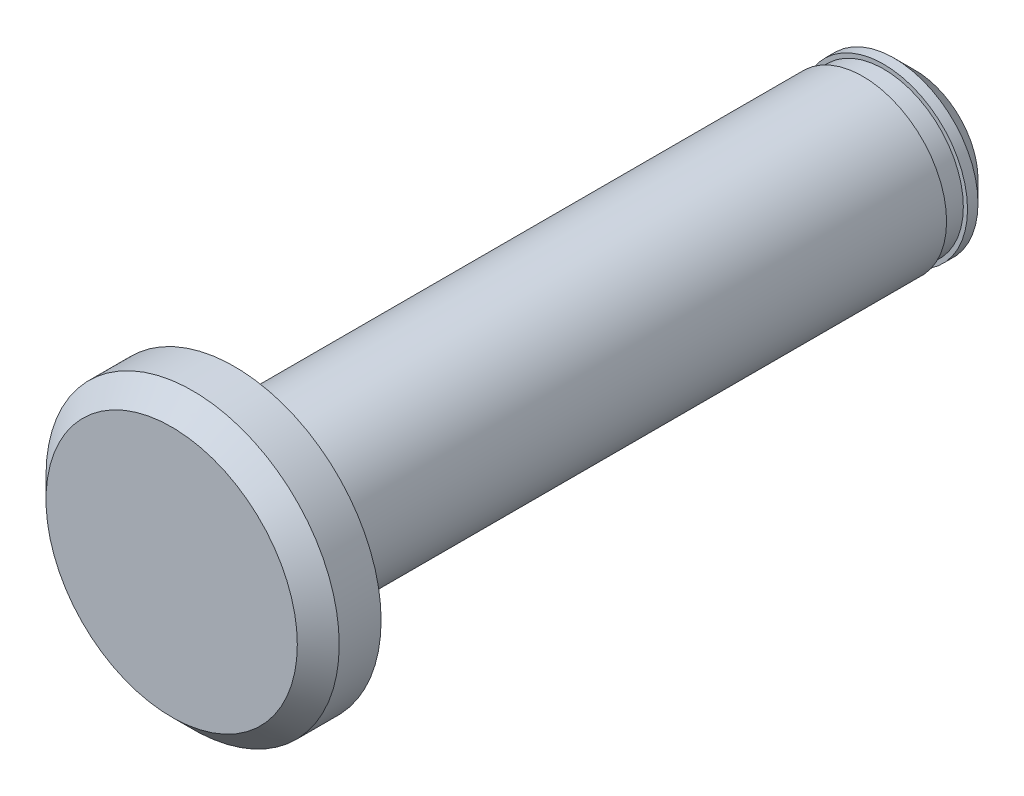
ISO-10303-21;
HEADER;
FILE_DESCRIPTION(('STEP AP214'),'2;1');
FILE_NAME('part.step','',(''),(''),'','','');
FILE_SCHEMA(('AUTOMOTIVE_DESIGN { 1 0 10303 214 1 1 1 1 }'));
ENDSEC;
DATA;
#1=APPLICATION_CONTEXT('core data for automotive mechanical design processes');
#2=APPLICATION_PROTOCOL_DEFINITION('international standard','automotive_design',2000,#1);
#3=PRODUCT_CONTEXT('',#1,'mechanical');
#4=PRODUCT('Part','Part','',(#3));
#5=PRODUCT_RELATED_PRODUCT_CATEGORY('part','',(#4));
#6=PRODUCT_DEFINITION_FORMATION('','',#4);
#7=PRODUCT_DEFINITION_CONTEXT('part definition',#1,'design');
#8=PRODUCT_DEFINITION('design','',#6,#7);
#9=PRODUCT_DEFINITION_SHAPE('','',#8);
#10=(LENGTH_UNIT() NAMED_UNIT(*) SI_UNIT(.MILLI.,.METRE.));
#11=(NAMED_UNIT(*) PLANE_ANGLE_UNIT() SI_UNIT($,.RADIAN.));
#12=(NAMED_UNIT(*) SI_UNIT($,.STERADIAN.) SOLID_ANGLE_UNIT());
#13=UNCERTAINTY_MEASURE_WITH_UNIT(LENGTH_MEASURE(1.E-05),#10,'distance_accuracy_value','');
#14=(GEOMETRIC_REPRESENTATION_CONTEXT(3) GLOBAL_UNCERTAINTY_ASSIGNED_CONTEXT((#13)) GLOBAL_UNIT_ASSIGNED_CONTEXT((#10,
#11,#12)) REPRESENTATION_CONTEXT('',''));
#15=CARTESIAN_POINT('',(0.,0.,0.));
#16=DIRECTION('',(0.,0.,1.));
#17=DIRECTION('',(1.,0.,0.));
#18=AXIS2_PLACEMENT_3D('',#15,#16,#17);
#19=CARTESIAN_POINT('',(-16.6807803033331,0.,40.5991607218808));
#20=DIRECTION('',(0.,0.,1.));
#21=DIRECTION('',(1.,0.,0.));
#22=AXIS2_PLACEMENT_3D('',#19,#20,#21);
#23=PLANE('',#22);
#24=CARTESIAN_POINT('',(-12.6807803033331,0.,40.5991607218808));
#25=DIRECTION('',(0.,0.,1.));
#26=DIRECTION('',(1.,0.,0.));
#27=AXIS2_PLACEMENT_3D('',#24,#25,#26);
#28=CIRCLE('',#27,7.);
#29=CARTESIAN_POINT('',(-5.68078030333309,0.,40.5991607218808));
#30=VERTEX_POINT('',#29);
#31=EDGE_CURVE('E38',#30,#30,#28,.T.);
#32=ORIENTED_EDGE('',*,*,#31,.F.);
#33=EDGE_LOOP('',(#32));
#34=FACE_BOUND('',#33,.T.);
#35=CARTESIAN_POINT('',(-12.6807803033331,0.,40.5991607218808));
#36=DIRECTION('',(0.,0.,1.));
#37=DIRECTION('',(1.,0.,0.));
#38=AXIS2_PLACEMENT_3D('',#35,#36,#37);
#39=CIRCLE('',#38,4.00000000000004);
#40=CARTESIAN_POINT('',(-8.68078030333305,0.,40.5991607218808));
#41=VERTEX_POINT('',#40);
#42=EDGE_CURVE('E10',#41,#41,#39,.T.);
#43=ORIENTED_EDGE('',*,*,#42,.T.);
#44=EDGE_LOOP('',(#43));
#45=FACE_BOUND('',#44,.T.);
#46=ADVANCED_FACE('F32',(#34,#45),#23,.F.);
#47=CARTESIAN_POINT('',(-12.6807803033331,0.,67.5379149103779));
#48=DIRECTION('',(0.,0.,1.));
#49=DIRECTION('',(1.,0.,0.));
#50=AXIS2_PLACEMENT_3D('',#47,#48,#49);
#51=CYLINDRICAL_SURFACE('',#50,7.);
#52=CARTESIAN_POINT('',(-12.6807803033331,0.,42.5991607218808));
#53=DIRECTION('',(0.,0.,1.));
#54=DIRECTION('',(1.,0.,0.));
#55=AXIS2_PLACEMENT_3D('',#52,#53,#54);
#56=CIRCLE('',#55,7.);
#57=CARTESIAN_POINT('',(-5.6807803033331,0.,42.5991607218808));
#58=VERTEX_POINT('',#57);
#59=EDGE_CURVE('E42',#58,#58,#56,.T.);
#60=ORIENTED_EDGE('',*,*,#59,.F.);
#61=EDGE_LOOP('',(#60));
#62=FACE_BOUND('',#61,.T.);
#63=ORIENTED_EDGE('',*,*,#31,.T.);
#64=EDGE_LOOP('',(#63));
#65=FACE_BOUND('',#64,.T.);
#66=ADVANCED_FACE('F87',(#62,#65),#51,.T.);
#67=CARTESIAN_POINT('',(-12.6807803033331,0.,42.5991607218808));
#68=DIRECTION('',(0.,0.,-1.));
#69=DIRECTION('',(-1.,0.,0.));
#70=AXIS2_PLACEMENT_3D('',#67,#68,#69);
#71=CONICAL_SURFACE('',#70,7.,0.785398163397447);
#72=CARTESIAN_POINT('',(-12.6807803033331,0.,43.5991607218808));
#73=DIRECTION('',(0.,0.,1.));
#74=DIRECTION('',(1.,0.,0.));
#75=AXIS2_PLACEMENT_3D('',#72,#73,#74);
#76=CIRCLE('',#75,6.);
#77=CARTESIAN_POINT('',(-6.68078030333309,0.,43.5991607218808));
#78=VERTEX_POINT('',#77);
#79=EDGE_CURVE('E46',#78,#78,#76,.T.);
#80=ORIENTED_EDGE('',*,*,#79,.F.);
#81=EDGE_LOOP('',(#80));
#82=FACE_BOUND('',#81,.T.);
#83=ORIENTED_EDGE('',*,*,#59,.T.);
#84=EDGE_LOOP('',(#83));
#85=FACE_BOUND('',#84,.T.);
#86=ADVANCED_FACE('F92',(#82,#85),#71,.T.);
#87=CARTESIAN_POINT('',(-18.6807803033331,0.,43.5991607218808));
#88=DIRECTION('',(0.,0.,-1.));
#89=DIRECTION('',(-1.,0.,0.));
#90=AXIS2_PLACEMENT_3D('',#87,#88,#89);
#91=PLANE('',#90);
#92=ORIENTED_EDGE('',*,*,#79,.T.);
#93=EDGE_LOOP('',(#92));
#94=FACE_BOUND('',#93,.T.);
#95=ADVANCED_FACE('F97',(#94),#91,.F.);
#96=CARTESIAN_POINT('',(-15.6807803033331,0.,8.09916072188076));
#97=DIRECTION('',(0.,0.,-1.));
#98=DIRECTION('',(-1.,0.,0.));
#99=AXIS2_PLACEMENT_3D('',#96,#97,#98);
#100=PLANE('',#99);
#101=CARTESIAN_POINT('',(-12.6807803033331,0.,8.09916072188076));
#102=DIRECTION('',(0.,0.,1.));
#103=DIRECTION('',(1.,0.,0.));
#104=AXIS2_PLACEMENT_3D('',#101,#102,#103);
#105=CIRCLE('',#104,3.);
#106=CARTESIAN_POINT('',(-9.68078030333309,0.,8.09916072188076));
#107=VERTEX_POINT('',#106);
#108=EDGE_CURVE('E51',#107,#107,#105,.T.);
#109=ORIENTED_EDGE('',*,*,#108,.F.);
#110=EDGE_LOOP('',(#109));
#111=FACE_BOUND('',#110,.T.);
#112=ADVANCED_FACE('F104',(#111),#100,.T.);
#113=CARTESIAN_POINT('',(-12.6807803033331,0.,9.09916072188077));
#114=DIRECTION('',(0.,0.,1.));
#115=DIRECTION('',(1.,0.,0.));
#116=AXIS2_PLACEMENT_3D('',#113,#114,#115);
#117=CONICAL_SURFACE('',#116,4.,0.785398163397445);
#118=ORIENTED_EDGE('',*,*,#108,.T.);
#119=EDGE_LOOP('',(#118));
#120=FACE_BOUND('',#119,.T.);
#121=CARTESIAN_POINT('',(-12.6807803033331,0.,9.09916072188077));
#122=DIRECTION('',(0.,0.,1.));
#123=DIRECTION('',(1.,0.,0.));
#124=AXIS2_PLACEMENT_3D('',#121,#122,#123);
#125=CIRCLE('',#124,4.);
#126=CARTESIAN_POINT('',(-8.68078030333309,0.,9.09916072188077));
#127=VERTEX_POINT('',#126);
#128=EDGE_CURVE('E54',#127,#127,#125,.T.);
#129=ORIENTED_EDGE('',*,*,#128,.F.);
#130=EDGE_LOOP('',(#129));
#131=FACE_BOUND('',#130,.T.);
#132=ADVANCED_FACE('F108',(#120,#131),#117,.T.);
#133=CARTESIAN_POINT('',(-12.6807803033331,0.,67.5379149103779));
#134=DIRECTION('',(0.,0.,1.));
#135=DIRECTION('',(1.,0.,0.));
#136=AXIS2_PLACEMENT_3D('',#133,#134,#135);
#137=CYLINDRICAL_SURFACE('',#136,4.);
#138=ORIENTED_EDGE('',*,*,#128,.T.);
#139=EDGE_LOOP('',(#138));
#140=FACE_BOUND('',#139,.T.);
#141=CARTESIAN_POINT('',(-12.6807803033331,0.,9.59916072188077));
#142=DIRECTION('',(0.,0.,1.));
#143=DIRECTION('',(1.,0.,0.));
#144=AXIS2_PLACEMENT_3D('',#141,#142,#143);
#145=CIRCLE('',#144,4.);
#146=CARTESIAN_POINT('',(-8.68078030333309,0.,9.59916072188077));
#147=VERTEX_POINT('',#146);
#148=EDGE_CURVE('E57',#147,#147,#145,.T.);
#149=ORIENTED_EDGE('',*,*,#148,.F.);
#150=EDGE_LOOP('',(#149));
#151=FACE_BOUND('',#150,.T.);
#152=ADVANCED_FACE('F112',(#140,#151),#137,.T.);
#153=CARTESIAN_POINT('',(-16.4807803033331,0.,9.59916072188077));
#154=DIRECTION('',(0.,0.,1.));
#155=DIRECTION('',(1.,0.,0.));
#156=AXIS2_PLACEMENT_3D('',#153,#154,#155);
#157=PLANE('',#156);
#158=ORIENTED_EDGE('',*,*,#148,.T.);
#159=EDGE_LOOP('',(#158));
#160=FACE_BOUND('',#159,.T.);
#161=CARTESIAN_POINT('',(-12.6807803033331,0.,9.59916072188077));
#162=DIRECTION('',(0.,0.,1.));
#163=DIRECTION('',(1.,0.,0.));
#164=AXIS2_PLACEMENT_3D('',#161,#162,#163);
#165=CIRCLE('',#164,3.8);
#166=CARTESIAN_POINT('',(-8.88078030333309,0.,9.59916072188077));
#167=VERTEX_POINT('',#166);
#168=EDGE_CURVE('E60',#167,#167,#165,.T.);
#169=ORIENTED_EDGE('',*,*,#168,.F.);
#170=EDGE_LOOP('',(#169));
#171=FACE_BOUND('',#170,.T.);
#172=ADVANCED_FACE('F83',(#160,#171),#157,.T.);
#173=CARTESIAN_POINT('',(-12.6807803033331,0.,67.5379149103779));
#174=DIRECTION('',(0.,0.,1.));
#175=DIRECTION('',(1.,0.,0.));
#176=AXIS2_PLACEMENT_3D('',#173,#174,#175);
#177=CYLINDRICAL_SURFACE('',#176,3.8);
#178=ORIENTED_EDGE('',*,*,#168,.T.);
#179=EDGE_LOOP('',(#178));
#180=FACE_BOUND('',#179,.T.);
#181=CARTESIAN_POINT('',(-12.6807803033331,0.,10.5991607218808));
#182=DIRECTION('',(0.,0.,1.));
#183=DIRECTION('',(1.,0.,0.));
#184=AXIS2_PLACEMENT_3D('',#181,#182,#183);
#185=CIRCLE('',#184,3.79999999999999);
#186=CARTESIAN_POINT('',(-8.8807803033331,0.,10.5991607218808));
#187=VERTEX_POINT('',#186);
#188=EDGE_CURVE('E63',#187,#187,#185,.T.);
#189=ORIENTED_EDGE('',*,*,#188,.F.);
#190=EDGE_LOOP('',(#189));
#191=FACE_BOUND('',#190,.T.);
#192=ADVANCED_FACE('F74',(#180,#191),#177,.T.);
#193=CARTESIAN_POINT('',(-16.6807803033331,0.,10.5991607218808));
#194=DIRECTION('',(0.,0.,-1.));
#195=DIRECTION('',(-1.,0.,0.));
#196=AXIS2_PLACEMENT_3D('',#193,#194,#195);
#197=PLANE('',#196);
#198=ORIENTED_EDGE('',*,*,#188,.T.);
#199=EDGE_LOOP('',(#198));
#200=FACE_BOUND('',#199,.T.);
#201=CARTESIAN_POINT('',(-12.6807803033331,0.,10.5991607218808));
#202=DIRECTION('',(0.,0.,1.));
#203=DIRECTION('',(1.,0.,0.));
#204=AXIS2_PLACEMENT_3D('',#201,#202,#203);
#205=CIRCLE('',#204,4.);
#206=CARTESIAN_POINT('',(-8.68078030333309,0.,10.5991607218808));
#207=VERTEX_POINT('',#206);
#208=EDGE_CURVE('E66',#207,#207,#205,.T.);
#209=ORIENTED_EDGE('',*,*,#208,.F.);
#210=EDGE_LOOP('',(#209));
#211=FACE_BOUND('',#210,.T.);
#212=ADVANCED_FACE('F72',(#200,#211),#197,.T.);
#213=CARTESIAN_POINT('',(-12.6807803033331,0.,67.5379149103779));
#214=DIRECTION('',(0.,0.,1.));
#215=DIRECTION('',(1.,0.,0.));
#216=AXIS2_PLACEMENT_3D('',#213,#214,#215);
#217=CYLINDRICAL_SURFACE('',#216,4.);
#218=ORIENTED_EDGE('',*,*,#42,.F.);
#219=EDGE_LOOP('',(#218));
#220=FACE_BOUND('',#219,.T.);
#221=ORIENTED_EDGE('',*,*,#208,.T.);
#222=EDGE_LOOP('',(#221));
#223=FACE_BOUND('',#222,.T.);
#224=ADVANCED_FACE('F70',(#220,#223),#217,.T.);
#225=CLOSED_SHELL('',(#46,#66,#86,#95,#112,#132,#152,#172,#192,#212,#224));
#226=MANIFOLD_SOLID_BREP('B2',#225);
#227=ADVANCED_BREP_SHAPE_REPRESENTATION('',(#18,#226),#14);
#228=SHAPE_DEFINITION_REPRESENTATION(#9,#227);
ENDSEC;
END-ISO-10303-21;
